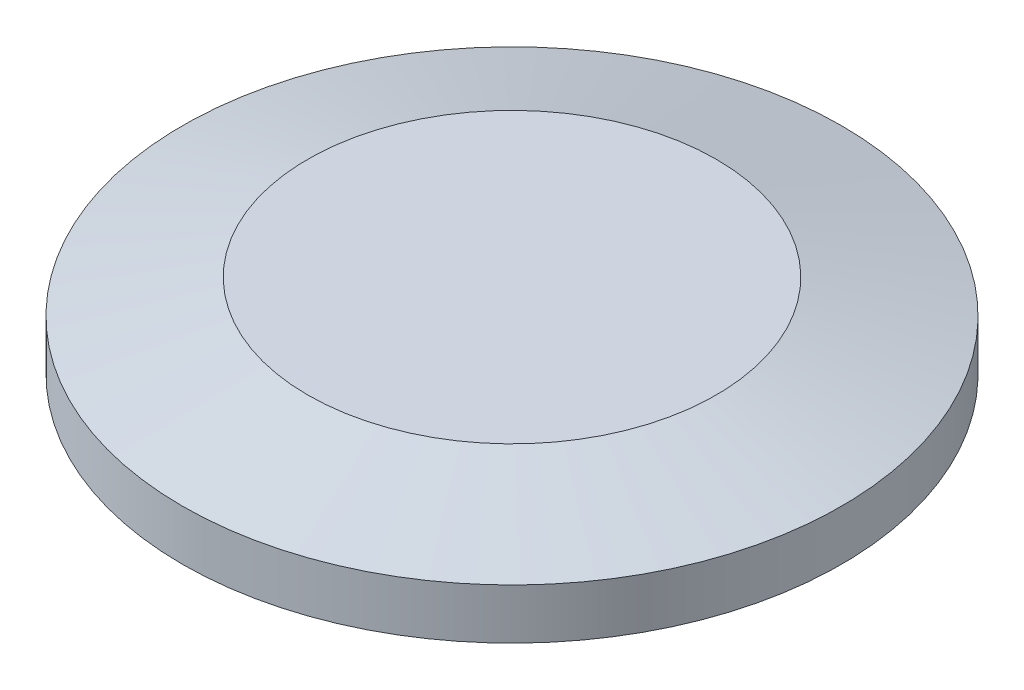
from build123d import *

# Parameters (mm, degrees)
SKETCH2_R          = 13.208
SKETCH2_R_2        = 10.033
CUT_EXTRUDE1_DEPTH = 1.524


with BuildPart() as part:
    # Sketch1 → Revolve1 (revolve)
    with BuildSketch(Plane(origin=(0, 0, 0), x_dir=(0, 0, -1), z_dir=(1, 0, 0)), mode=Mode.PRIVATE) as revolve1_sk:
        Polygon((0, 0), (19.939, 0), (19.939, 3.048), (12.355472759, 5.08), (0, 5.08), align=None)
    revolve(revolve1_sk.sketch.rotate(Axis((0, 0, 0), (0, -1, 0)), 180), axis=Axis((0, 0, 0), (0, -1, 0)))

    # Sketch2 → Cut-Extrude1 (cut)
    with BuildSketch(Plane.XZ):
        with Locations(Location((0, 0, 0), (0, 0, 270))):
            Circle(SKETCH2_R)
        with Locations(Location((0, 0, 0), (0, 0, 270))):
            Circle(SKETCH2_R_2, mode=Mode.SUBTRACT)
    extrude(amount=-CUT_EXTRUDE1_DEPTH, mode=Mode.SUBTRACT)


solid = part.part
